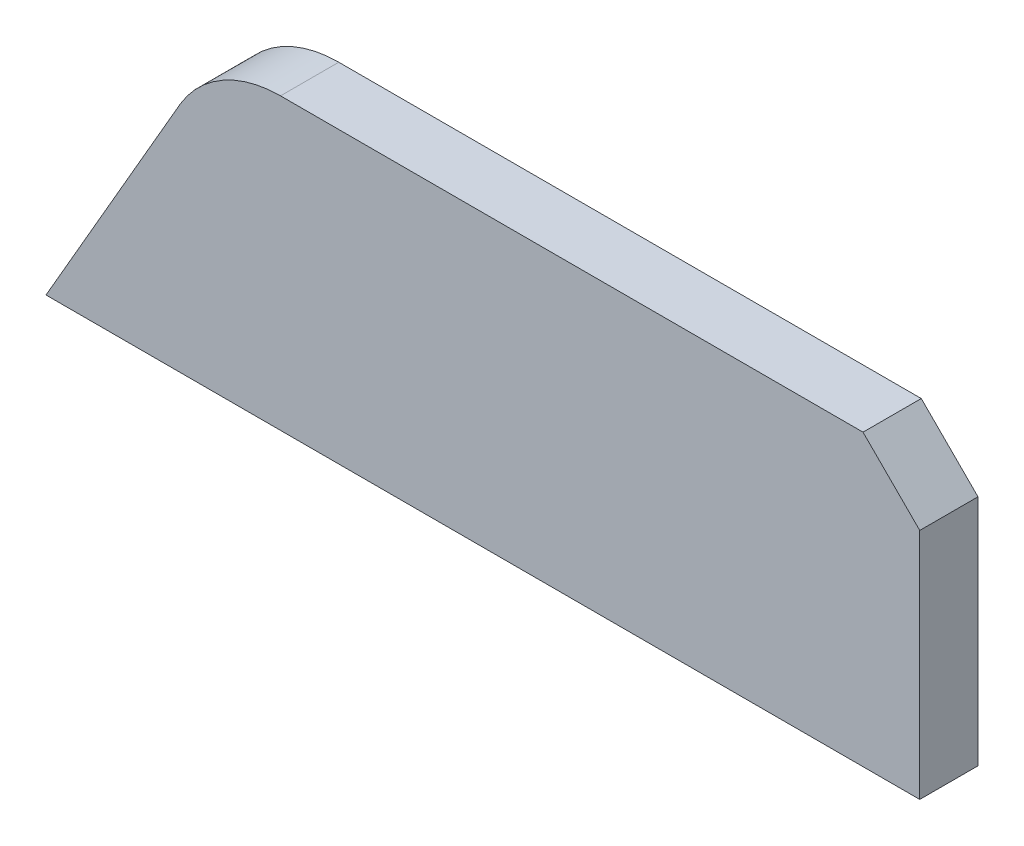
ISO-10303-21;
HEADER;
FILE_DESCRIPTION(('STEP AP214'),'2;1');
FILE_NAME('part.step','',(''),(''),'','','');
FILE_SCHEMA(('AUTOMOTIVE_DESIGN { 1 0 10303 214 1 1 1 1 }'));
ENDSEC;
DATA;
#1=APPLICATION_CONTEXT('core data for automotive mechanical design processes');
#2=APPLICATION_PROTOCOL_DEFINITION('international standard','automotive_design',2000,#1);
#3=PRODUCT_CONTEXT('',#1,'mechanical');
#4=PRODUCT('Part','Part','',(#3));
#5=PRODUCT_RELATED_PRODUCT_CATEGORY('part','',(#4));
#6=PRODUCT_DEFINITION_FORMATION('','',#4);
#7=PRODUCT_DEFINITION_CONTEXT('part definition',#1,'design');
#8=PRODUCT_DEFINITION('design','',#6,#7);
#9=PRODUCT_DEFINITION_SHAPE('','',#8);
#10=(LENGTH_UNIT() NAMED_UNIT(*) SI_UNIT(.MILLI.,.METRE.));
#11=(NAMED_UNIT(*) PLANE_ANGLE_UNIT() SI_UNIT($,.RADIAN.));
#12=(NAMED_UNIT(*) SI_UNIT($,.STERADIAN.) SOLID_ANGLE_UNIT());
#13=UNCERTAINTY_MEASURE_WITH_UNIT(LENGTH_MEASURE(1.E-05),#10,'distance_accuracy_value','');
#14=(GEOMETRIC_REPRESENTATION_CONTEXT(3) GLOBAL_UNCERTAINTY_ASSIGNED_CONTEXT((#13)) GLOBAL_UNIT_ASSIGNED_CONTEXT((#10,
#11,#12)) REPRESENTATION_CONTEXT('',''));
#15=CARTESIAN_POINT('',(0.,0.,0.));
#16=DIRECTION('',(0.,0.,1.));
#17=DIRECTION('',(1.,0.,0.));
#18=AXIS2_PLACEMENT_3D('',#15,#16,#17);
#19=CARTESIAN_POINT('',(-126.905989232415,40.,10.));
#20=DIRECTION('',(0.866025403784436,-0.500000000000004,0.));
#21=DIRECTION('',(0.500000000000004,0.866025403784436,0.));
#22=AXIS2_PLACEMENT_3D('',#19,#20,#21);
#23=PLANE('',#22);
#24=DIRECTION('',(-0.500000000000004,-0.866025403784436,0.));
#25=VECTOR('',#24,1.);
#26=CARTESIAN_POINT('',(-126.905989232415,40.,0.));
#27=LINE('',#26,#25);
#28=CARTESIAN_POINT('',(-126.905989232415,40.,0.));
#29=VERTEX_POINT('',#28);
#30=CARTESIAN_POINT('',(-150.,0.,0.));
#31=VERTEX_POINT('',#30);
#32=EDGE_CURVE('E134',#29,#31,#27,.T.);
#33=ORIENTED_EDGE('',*,*,#32,.T.);
#34=DIRECTION('',(0.,0.,-1.));
#35=VECTOR('',#34,1.);
#36=CARTESIAN_POINT('',(-150.,0.,10.));
#37=LINE('',#36,#35);
#38=CARTESIAN_POINT('',(-150.,0.,10.));
#39=VERTEX_POINT('',#38);
#40=EDGE_CURVE('E11',#39,#31,#37,.T.);
#41=ORIENTED_EDGE('',*,*,#40,.F.);
#42=DIRECTION('',(-0.500000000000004,-0.866025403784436,0.));
#43=VECTOR('',#42,1.);
#44=CARTESIAN_POINT('',(-126.905989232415,40.,10.));
#45=LINE('',#44,#43);
#46=CARTESIAN_POINT('',(-126.905989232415,40.,10.));
#47=VERTEX_POINT('',#46);
#48=EDGE_CURVE('E150',#47,#39,#45,.T.);
#49=ORIENTED_EDGE('',*,*,#48,.F.);
#50=DIRECTION('',(0.,0.,-1.));
#51=VECTOR('',#50,1.);
#52=CARTESIAN_POINT('',(-126.905989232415,40.,10.));
#53=LINE('',#52,#51);
#54=EDGE_CURVE('E130',#47,#29,#53,.T.);
#55=ORIENTED_EDGE('',*,*,#54,.T.);
#56=EDGE_LOOP('',(#33,#41,#49,#55));
#57=FACE_BOUND('',#56,.T.);
#58=ADVANCED_FACE('F45',(#57),#23,.F.);
#59=CARTESIAN_POINT('',(-150.,0.,10.));
#60=DIRECTION('',(0.,1.,0.));
#61=DIRECTION('',(0.,0.,1.));
#62=AXIS2_PLACEMENT_3D('',#59,#60,#61);
#63=PLANE('',#62);
#64=DIRECTION('',(1.,0.,0.));
#65=VECTOR('',#64,1.);
#66=CARTESIAN_POINT('',(-150.,0.,0.));
#67=LINE('',#66,#65);
#68=CARTESIAN_POINT('',(0.,0.,0.));
#69=VERTEX_POINT('',#68);
#70=EDGE_CURVE('E138',#31,#69,#67,.T.);
#71=ORIENTED_EDGE('',*,*,#70,.T.);
#72=DIRECTION('',(0.,0.,-1.));
#73=VECTOR('',#72,1.);
#74=CARTESIAN_POINT('',(0.,0.,10.));
#75=LINE('',#74,#73);
#76=CARTESIAN_POINT('',(0.,0.,10.));
#77=VERTEX_POINT('',#76);
#78=EDGE_CURVE('E54',#77,#69,#75,.T.);
#79=ORIENTED_EDGE('',*,*,#78,.F.);
#80=DIRECTION('',(1.,0.,0.));
#81=VECTOR('',#80,1.);
#82=CARTESIAN_POINT('',(-150.,0.,10.));
#83=LINE('',#82,#81);
#84=EDGE_CURVE('E99',#39,#77,#83,.T.);
#85=ORIENTED_EDGE('',*,*,#84,.F.);
#86=ORIENTED_EDGE('',*,*,#40,.T.);
#87=EDGE_LOOP('',(#71,#79,#85,#86));
#88=FACE_BOUND('',#87,.T.);
#89=ADVANCED_FACE('F178',(#88),#63,.F.);
#90=CARTESIAN_POINT('',(0.,0.,10.));
#91=DIRECTION('',(-1.,0.,0.));
#92=DIRECTION('',(0.,0.,1.));
#93=AXIS2_PLACEMENT_3D('',#90,#91,#92);
#94=PLANE('',#93);
#95=DIRECTION('',(0.,1.,0.));
#96=VECTOR('',#95,1.);
#97=CARTESIAN_POINT('',(0.,0.,0.));
#98=LINE('',#97,#96);
#99=CARTESIAN_POINT('',(0.,40.,0.));
#100=VERTEX_POINT('',#99);
#101=EDGE_CURVE('E141',#69,#100,#98,.T.);
#102=ORIENTED_EDGE('',*,*,#101,.T.);
#103=DIRECTION('',(0.,0.,-1.));
#104=VECTOR('',#103,1.);
#105=CARTESIAN_POINT('',(0.,40.,10.));
#106=LINE('',#105,#104);
#107=CARTESIAN_POINT('',(0.,40.,10.));
#108=VERTEX_POINT('',#107);
#109=EDGE_CURVE('E123',#108,#100,#106,.T.);
#110=ORIENTED_EDGE('',*,*,#109,.F.);
#111=DIRECTION('',(0.,1.,0.));
#112=VECTOR('',#111,1.);
#113=CARTESIAN_POINT('',(0.,0.,10.));
#114=LINE('',#113,#112);
#115=EDGE_CURVE('E112',#77,#108,#114,.T.);
#116=ORIENTED_EDGE('',*,*,#115,.F.);
#117=ORIENTED_EDGE('',*,*,#78,.T.);
#118=EDGE_LOOP('',(#102,#110,#116,#117));
#119=FACE_BOUND('',#118,.T.);
#120=ADVANCED_FACE('F160',(#119),#94,.F.);
#121=CARTESIAN_POINT('',(0.,40.,10.));
#122=DIRECTION('',(-0.707106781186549,-0.707106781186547,0.));
#123=DIRECTION('',(0.707106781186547,-0.707106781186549,0.));
#124=AXIS2_PLACEMENT_3D('',#121,#122,#123);
#125=PLANE('',#124);
#126=DIRECTION('',(-0.707106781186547,0.707106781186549,0.));
#127=VECTOR('',#126,1.);
#128=CARTESIAN_POINT('',(0.,40.,0.));
#129=LINE('',#128,#127);
#130=CARTESIAN_POINT('',(-9.73888406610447,49.7388840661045,0.));
#131=VERTEX_POINT('',#130);
#132=EDGE_CURVE('E121',#100,#131,#129,.T.);
#133=ORIENTED_EDGE('',*,*,#132,.T.);
#134=DIRECTION('',(0.,0.,-1.));
#135=VECTOR('',#134,1.);
#136=CARTESIAN_POINT('',(-9.73888406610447,49.7388840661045,10.));
#137=LINE('',#136,#135);
#138=CARTESIAN_POINT('',(-9.73888406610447,49.7388840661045,10.));
#139=VERTEX_POINT('',#138);
#140=EDGE_CURVE('E118',#139,#131,#137,.T.);
#141=ORIENTED_EDGE('',*,*,#140,.F.);
#142=DIRECTION('',(-0.707106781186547,0.707106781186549,0.));
#143=VECTOR('',#142,1.);
#144=CARTESIAN_POINT('',(0.,40.,10.));
#145=LINE('',#144,#143);
#146=EDGE_CURVE('E106',#108,#139,#145,.T.);
#147=ORIENTED_EDGE('',*,*,#146,.F.);
#148=ORIENTED_EDGE('',*,*,#109,.T.);
#149=EDGE_LOOP('',(#133,#141,#147,#148));
#150=FACE_BOUND('',#149,.T.);
#151=ADVANCED_FACE('F119',(#150),#125,.F.);
#152=CARTESIAN_POINT('',(-9.73888406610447,49.7388840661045,10.));
#153=DIRECTION('',(0.,-1.,0.));
#154=DIRECTION('',(1.,0.,0.));
#155=AXIS2_PLACEMENT_3D('',#152,#153,#154);
#156=PLANE('',#155);
#157=DIRECTION('',(-1.,0.,0.));
#158=VECTOR('',#157,1.);
#159=CARTESIAN_POINT('',(-9.73888406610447,49.7388840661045,0.));
#160=LINE('',#159,#158);
#161=CARTESIAN_POINT('',(-109.738884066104,49.7388840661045,0.));
#162=VERTEX_POINT('',#161);
#163=EDGE_CURVE('E85',#131,#162,#160,.T.);
#164=ORIENTED_EDGE('',*,*,#163,.T.);
#165=DIRECTION('',(0.,0.,-1.));
#166=VECTOR('',#165,1.);
#167=CARTESIAN_POINT('',(-109.738884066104,49.7388840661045,10.));
#168=LINE('',#167,#166);
#169=CARTESIAN_POINT('',(-109.738884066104,49.7388840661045,10.));
#170=VERTEX_POINT('',#169);
#171=EDGE_CURVE('E124',#170,#162,#168,.T.);
#172=ORIENTED_EDGE('',*,*,#171,.F.);
#173=DIRECTION('',(-1.,0.,0.));
#174=VECTOR('',#173,1.);
#175=CARTESIAN_POINT('',(-9.73888406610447,49.7388840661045,10.));
#176=LINE('',#175,#174);
#177=EDGE_CURVE('E110',#139,#170,#176,.T.);
#178=ORIENTED_EDGE('',*,*,#177,.F.);
#179=ORIENTED_EDGE('',*,*,#140,.T.);
#180=EDGE_LOOP('',(#164,#172,#178,#179));
#181=FACE_BOUND('',#180,.T.);
#182=ADVANCED_FACE('F126',(#181),#156,.F.);
#183=CARTESIAN_POINT('',(-109.738884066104,29.7388840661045,10.));
#184=DIRECTION('',(0.,0.,-1.));
#185=DIRECTION('',(-1.,0.,0.));
#186=AXIS2_PLACEMENT_3D('',#183,#184,#185);
#187=CYLINDRICAL_SURFACE('',#186,20.);
#188=CARTESIAN_POINT('',(-109.738884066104,29.7388840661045,0.));
#189=DIRECTION('',(0.,0.,1.));
#190=DIRECTION('',(1.,0.,0.));
#191=AXIS2_PLACEMENT_3D('',#188,#189,#190);
#192=CIRCLE('',#191,20.);
#193=EDGE_CURVE('E91',#162,#29,#192,.T.);
#194=ORIENTED_EDGE('',*,*,#193,.T.);
#195=ORIENTED_EDGE('',*,*,#54,.F.);
#196=CARTESIAN_POINT('',(-109.738884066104,29.7388840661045,10.));
#197=DIRECTION('',(0.,0.,1.));
#198=DIRECTION('',(1.,0.,0.));
#199=AXIS2_PLACEMENT_3D('',#196,#197,#198);
#200=CIRCLE('',#199,20.);
#201=EDGE_CURVE('E62',#170,#47,#200,.T.);
#202=ORIENTED_EDGE('',*,*,#201,.F.);
#203=ORIENTED_EDGE('',*,*,#171,.T.);
#204=EDGE_LOOP('',(#194,#195,#202,#203));
#205=FACE_BOUND('',#204,.T.);
#206=ADVANCED_FACE('F167',(#205),#187,.T.);
#207=CARTESIAN_POINT('',(-109.738884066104,29.7388840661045,10.));
#208=DIRECTION('',(0.,0.,1.));
#209=DIRECTION('',(1.,0.,0.));
#210=AXIS2_PLACEMENT_3D('',#207,#208,#209);
#211=PLANE('',#210);
#212=ORIENTED_EDGE('',*,*,#48,.T.);
#213=ORIENTED_EDGE('',*,*,#84,.T.);
#214=ORIENTED_EDGE('',*,*,#115,.T.);
#215=ORIENTED_EDGE('',*,*,#146,.T.);
#216=ORIENTED_EDGE('',*,*,#177,.T.);
#217=ORIENTED_EDGE('',*,*,#201,.T.);
#218=EDGE_LOOP('',(#212,#213,#214,#215,#216,#217));
#219=FACE_BOUND('',#218,.T.);
#220=ADVANCED_FACE('F108',(#219),#211,.T.);
#221=CARTESIAN_POINT('',(-109.738884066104,29.7388840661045,0.));
#222=DIRECTION('',(0.,0.,1.));
#223=DIRECTION('',(1.,0.,0.));
#224=AXIS2_PLACEMENT_3D('',#221,#222,#223);
#225=PLANE('',#224);
#226=ORIENTED_EDGE('',*,*,#32,.F.);
#227=ORIENTED_EDGE('',*,*,#193,.F.);
#228=ORIENTED_EDGE('',*,*,#163,.F.);
#229=ORIENTED_EDGE('',*,*,#132,.F.);
#230=ORIENTED_EDGE('',*,*,#101,.F.);
#231=ORIENTED_EDGE('',*,*,#70,.F.);
#232=EDGE_LOOP('',(#226,#227,#228,#229,#230,#231));
#233=FACE_BOUND('',#232,.T.);
#234=ADVANCED_FACE('F163',(#233),#225,.F.);
#235=CLOSED_SHELL('',(#58,#89,#120,#151,#182,#206,#220,#234));
#236=MANIFOLD_SOLID_BREP('B2',#235);
#237=ADVANCED_BREP_SHAPE_REPRESENTATION('',(#18,#236),#14);
#238=SHAPE_DEFINITION_REPRESENTATION(#9,#237);
ENDSEC;
END-ISO-10303-21;
